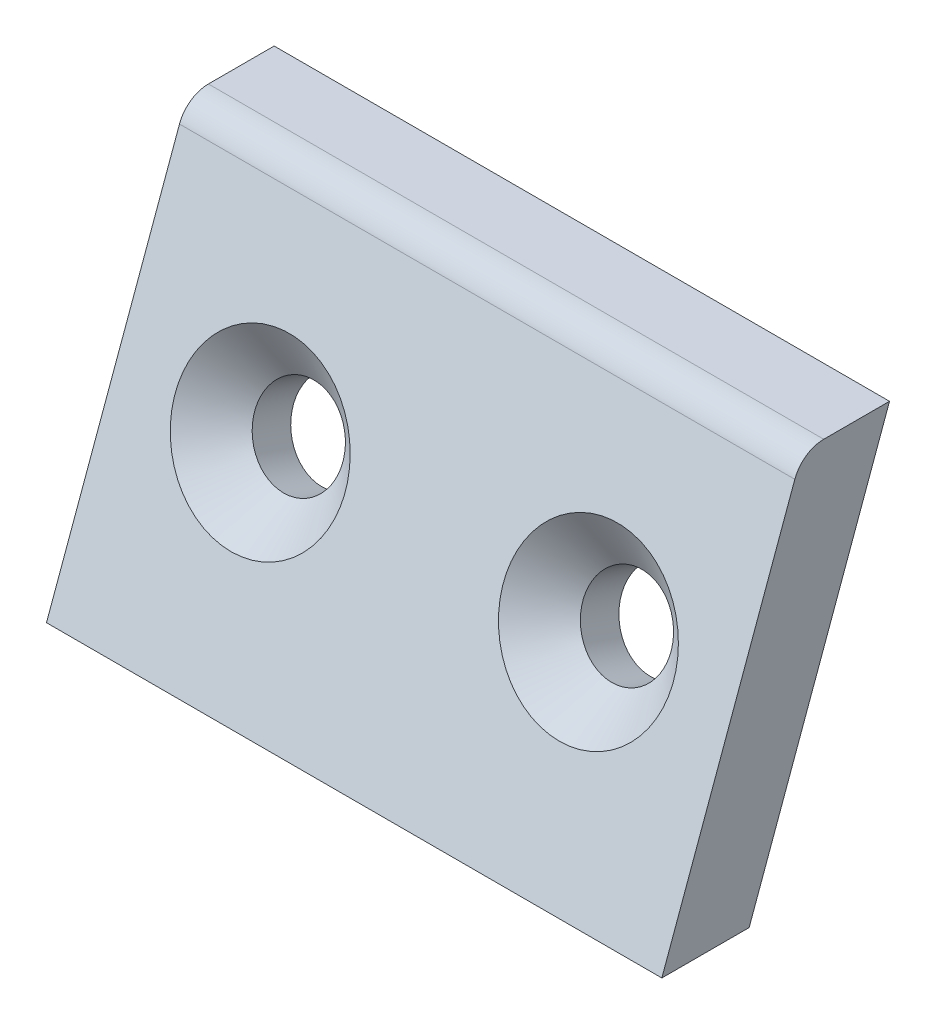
from build123d import *

# Parameters (mm, degrees)
BOSS_EXTRU_1_DEPTH                             = 30
FRAISAGE_POUR_VIS_T_TE_FRAIS_E_M21_D           = 4.3
FRAISAGE_POUR_VIS_T_TE_FRAIS_E_M21_CSINK_D     = 8.3
FRAISAGE_POUR_VIS_T_TE_FRAIS_E_M21_CSINK_ANGLE = 90


with BuildPart() as part:
    # Esquisse1 → Boss.-Extru.1 (new body)
    with BuildSketch(Plane(origin=(0, 0, 0), x_dir=(0, 0, -1), z_dir=(1, 0, 0))):
        with BuildLine():
            Line((0, 0), (6.48341278, 17.813030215))
            ThreePointArc((6.48341278, 17.813030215), (7.032587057, 18.528728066), (7.892951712, 18.8))
            Line((7.892951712, 18.8), (11.099351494, 18.8))
            Line((11.099351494, 18.8), (4.25671109, 0))
            Line((4.25671109, 0), (0, 0))
        make_face()
    extrude(amount=BOSS_EXTRU_1_DEPTH)

    # Fraisage pour vis _ t_te frais_e M21 (through all)
    with Locations(Plane(origin=(0, 0, 0), x_dir=(1, 0, 0), z_dir=(0, 0.34202014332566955, 0.9396926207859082))):
        with Locations((7, 10), (23, 10)):
            CounterSinkHole(FRAISAGE_POUR_VIS_T_TE_FRAIS_E_M21_D / 2, FRAISAGE_POUR_VIS_T_TE_FRAIS_E_M21_CSINK_D / 2, counter_sink_angle=FRAISAGE_POUR_VIS_T_TE_FRAIS_E_M21_CSINK_ANGLE)


solid = part.part
